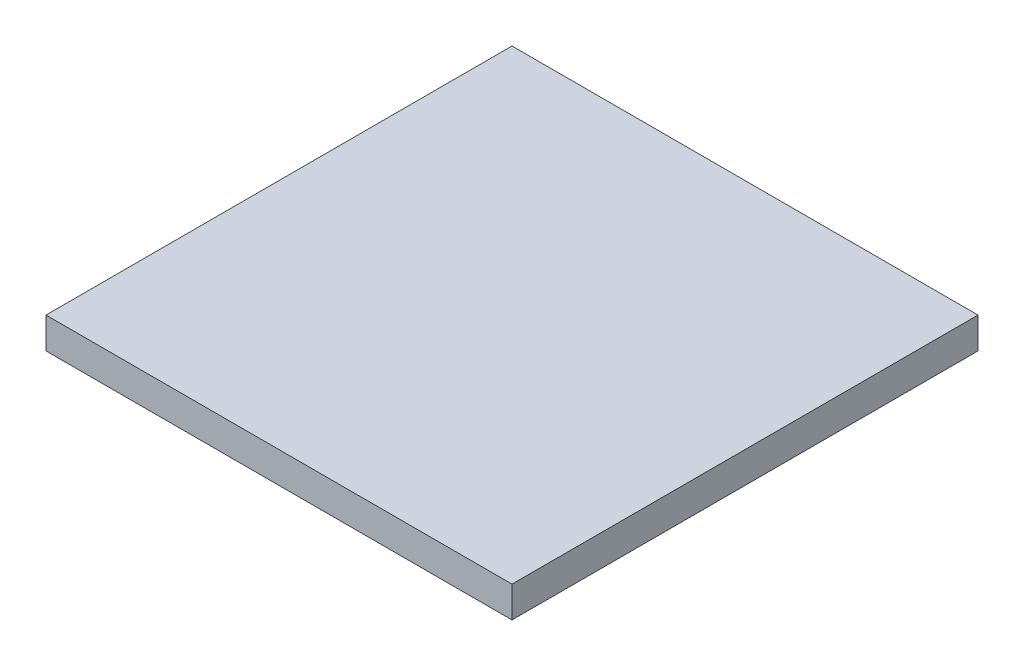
ISO-10303-21;
HEADER;
FILE_DESCRIPTION(('STEP AP214'),'2;1');
FILE_NAME('part.step','',(''),(''),'','','');
FILE_SCHEMA(('AUTOMOTIVE_DESIGN { 1 0 10303 214 1 1 1 1 }'));
ENDSEC;
DATA;
#1=APPLICATION_CONTEXT('core data for automotive mechanical design processes');
#2=APPLICATION_PROTOCOL_DEFINITION('international standard','automotive_design',2000,#1);
#3=PRODUCT_CONTEXT('',#1,'mechanical');
#4=PRODUCT('Part','Part','',(#3));
#5=PRODUCT_RELATED_PRODUCT_CATEGORY('part','',(#4));
#6=PRODUCT_DEFINITION_FORMATION('','',#4);
#7=PRODUCT_DEFINITION_CONTEXT('part definition',#1,'design');
#8=PRODUCT_DEFINITION('design','',#6,#7);
#9=PRODUCT_DEFINITION_SHAPE('','',#8);
#10=(LENGTH_UNIT() NAMED_UNIT(*) SI_UNIT(.MILLI.,.METRE.));
#11=(NAMED_UNIT(*) PLANE_ANGLE_UNIT() SI_UNIT($,.RADIAN.));
#12=(NAMED_UNIT(*) SI_UNIT($,.STERADIAN.) SOLID_ANGLE_UNIT());
#13=UNCERTAINTY_MEASURE_WITH_UNIT(LENGTH_MEASURE(1.E-05),#10,'distance_accuracy_value','');
#14=(GEOMETRIC_REPRESENTATION_CONTEXT(3) GLOBAL_UNCERTAINTY_ASSIGNED_CONTEXT((#13)) GLOBAL_UNIT_ASSIGNED_CONTEXT((#10,
#11,#12)) REPRESENTATION_CONTEXT('',''));
#15=CARTESIAN_POINT('',(0.,0.,0.));
#16=DIRECTION('',(0.,0.,1.));
#17=DIRECTION('',(1.,0.,0.));
#18=AXIS2_PLACEMENT_3D('',#15,#16,#17);
#19=CARTESIAN_POINT('',(0.,4.,0.));
#20=DIRECTION('',(1.,0.,0.));
#21=DIRECTION('',(0.,0.,-1.));
#22=AXIS2_PLACEMENT_3D('',#19,#20,#21);
#23=PLANE('',#22);
#24=DIRECTION('',(0.,0.,1.));
#25=VECTOR('',#24,1.);
#26=CARTESIAN_POINT('',(0.,0.,0.));
#27=LINE('',#26,#25);
#28=CARTESIAN_POINT('',(0.,0.,-60.));
#29=VERTEX_POINT('',#28);
#30=CARTESIAN_POINT('',(0.,0.,0.));
#31=VERTEX_POINT('',#30);
#32=EDGE_CURVE('E94',#29,#31,#27,.T.);
#33=ORIENTED_EDGE('',*,*,#32,.T.);
#34=DIRECTION('',(0.,-1.,0.));
#35=VECTOR('',#34,1.);
#36=CARTESIAN_POINT('',(0.,4.,0.));
#37=LINE('',#36,#35);
#38=CARTESIAN_POINT('',(0.,4.,0.));
#39=VERTEX_POINT('',#38);
#40=EDGE_CURVE('E11',#39,#31,#37,.T.);
#41=ORIENTED_EDGE('',*,*,#40,.F.);
#42=DIRECTION('',(0.,0.,1.));
#43=VECTOR('',#42,1.);
#44=CARTESIAN_POINT('',(0.,4.,0.));
#45=LINE('',#44,#43);
#46=CARTESIAN_POINT('',(0.,4.,-60.));
#47=VERTEX_POINT('',#46);
#48=EDGE_CURVE('E82',#47,#39,#45,.T.);
#49=ORIENTED_EDGE('',*,*,#48,.F.);
#50=DIRECTION('',(0.,-1.,0.));
#51=VECTOR('',#50,1.);
#52=CARTESIAN_POINT('',(0.,4.,-60.));
#53=LINE('',#52,#51);
#54=EDGE_CURVE('E90',#47,#29,#53,.T.);
#55=ORIENTED_EDGE('',*,*,#54,.T.);
#56=EDGE_LOOP('',(#33,#41,#49,#55));
#57=FACE_BOUND('',#56,.T.);
#58=ADVANCED_FACE('F31',(#57),#23,.F.);
#59=CARTESIAN_POINT('',(0.,4.,0.));
#60=DIRECTION('',(0.,0.,-1.));
#61=DIRECTION('',(-1.,0.,0.));
#62=AXIS2_PLACEMENT_3D('',#59,#60,#61);
#63=PLANE('',#62);
#64=DIRECTION('',(1.,0.,0.));
#65=VECTOR('',#64,1.);
#66=CARTESIAN_POINT('',(0.,0.,0.));
#67=LINE('',#66,#65);
#68=CARTESIAN_POINT('',(60.,0.,0.));
#69=VERTEX_POINT('',#68);
#70=EDGE_CURVE('E86',#31,#69,#67,.T.);
#71=ORIENTED_EDGE('',*,*,#70,.T.);
#72=DIRECTION('',(0.,-1.,0.));
#73=VECTOR('',#72,1.);
#74=CARTESIAN_POINT('',(60.,4.,0.));
#75=LINE('',#74,#73);
#76=CARTESIAN_POINT('',(60.,4.,0.));
#77=VERTEX_POINT('',#76);
#78=EDGE_CURVE('E39',#77,#69,#75,.T.);
#79=ORIENTED_EDGE('',*,*,#78,.F.);
#80=DIRECTION('',(1.,0.,0.));
#81=VECTOR('',#80,1.);
#82=CARTESIAN_POINT('',(0.,4.,0.));
#83=LINE('',#82,#81);
#84=EDGE_CURVE('E77',#39,#77,#83,.T.);
#85=ORIENTED_EDGE('',*,*,#84,.F.);
#86=ORIENTED_EDGE('',*,*,#40,.T.);
#87=EDGE_LOOP('',(#71,#79,#85,#86));
#88=FACE_BOUND('',#87,.T.);
#89=ADVANCED_FACE('F85',(#88),#63,.F.);
#90=CARTESIAN_POINT('',(60.,4.,0.));
#91=DIRECTION('',(-1.,0.,0.));
#92=DIRECTION('',(0.,0.,1.));
#93=AXIS2_PLACEMENT_3D('',#90,#91,#92);
#94=PLANE('',#93);
#95=DIRECTION('',(0.,0.,-1.));
#96=VECTOR('',#95,1.);
#97=CARTESIAN_POINT('',(60.,0.,0.));
#98=LINE('',#97,#96);
#99=CARTESIAN_POINT('',(60.,0.,-60.));
#100=VERTEX_POINT('',#99);
#101=EDGE_CURVE('E64',#69,#100,#98,.T.);
#102=ORIENTED_EDGE('',*,*,#101,.T.);
#103=DIRECTION('',(0.,-1.,0.));
#104=VECTOR('',#103,1.);
#105=CARTESIAN_POINT('',(60.,4.,-60.));
#106=LINE('',#105,#104);
#107=CARTESIAN_POINT('',(60.,4.,-60.));
#108=VERTEX_POINT('',#107);
#109=EDGE_CURVE('E87',#108,#100,#106,.T.);
#110=ORIENTED_EDGE('',*,*,#109,.F.);
#111=DIRECTION('',(0.,0.,-1.));
#112=VECTOR('',#111,1.);
#113=CARTESIAN_POINT('',(60.,4.,0.));
#114=LINE('',#113,#112);
#115=EDGE_CURVE('E80',#77,#108,#114,.T.);
#116=ORIENTED_EDGE('',*,*,#115,.F.);
#117=ORIENTED_EDGE('',*,*,#78,.T.);
#118=EDGE_LOOP('',(#102,#110,#116,#117));
#119=FACE_BOUND('',#118,.T.);
#120=ADVANCED_FACE('F88',(#119),#94,.F.);
#121=CARTESIAN_POINT('',(0.,4.,-60.));
#122=DIRECTION('',(0.,0.,1.));
#123=DIRECTION('',(1.,0.,0.));
#124=AXIS2_PLACEMENT_3D('',#121,#122,#123);
#125=PLANE('',#124);
#126=DIRECTION('',(-1.,0.,0.));
#127=VECTOR('',#126,1.);
#128=CARTESIAN_POINT('',(0.,0.,-60.));
#129=LINE('',#128,#127);
#130=EDGE_CURVE('E70',#100,#29,#129,.T.);
#131=ORIENTED_EDGE('',*,*,#130,.T.);
#132=ORIENTED_EDGE('',*,*,#54,.F.);
#133=DIRECTION('',(-1.,0.,0.));
#134=VECTOR('',#133,1.);
#135=CARTESIAN_POINT('',(0.,4.,-60.));
#136=LINE('',#135,#134);
#137=EDGE_CURVE('E47',#108,#47,#136,.T.);
#138=ORIENTED_EDGE('',*,*,#137,.F.);
#139=ORIENTED_EDGE('',*,*,#109,.T.);
#140=EDGE_LOOP('',(#131,#132,#138,#139));
#141=FACE_BOUND('',#140,.T.);
#142=ADVANCED_FACE('F101',(#141),#125,.F.);
#143=CARTESIAN_POINT('',(0.,4.,-60.));
#144=DIRECTION('',(0.,-1.,0.));
#145=DIRECTION('',(0.,0.,-1.));
#146=AXIS2_PLACEMENT_3D('',#143,#144,#145);
#147=PLANE('',#146);
#148=ORIENTED_EDGE('',*,*,#48,.T.);
#149=ORIENTED_EDGE('',*,*,#84,.T.);
#150=ORIENTED_EDGE('',*,*,#115,.T.);
#151=ORIENTED_EDGE('',*,*,#137,.T.);
#152=EDGE_LOOP('',(#148,#149,#150,#151));
#153=FACE_BOUND('',#152,.T.);
#154=ADVANCED_FACE('F78',(#153),#147,.F.);
#155=CARTESIAN_POINT('',(0.,0.,-60.));
#156=DIRECTION('',(0.,-1.,0.));
#157=DIRECTION('',(0.,0.,-1.));
#158=AXIS2_PLACEMENT_3D('',#155,#156,#157);
#159=PLANE('',#158);
#160=ORIENTED_EDGE('',*,*,#32,.F.);
#161=ORIENTED_EDGE('',*,*,#130,.F.);
#162=ORIENTED_EDGE('',*,*,#101,.F.);
#163=ORIENTED_EDGE('',*,*,#70,.F.);
#164=EDGE_LOOP('',(#160,#161,#162,#163));
#165=FACE_BOUND('',#164,.T.);
#166=ADVANCED_FACE('F104',(#165),#159,.T.);
#167=CLOSED_SHELL('',(#58,#89,#120,#142,#154,#166));
#168=MANIFOLD_SOLID_BREP('B2',#167);
#169=ADVANCED_BREP_SHAPE_REPRESENTATION('',(#18,#168),#14);
#170=SHAPE_DEFINITION_REPRESENTATION(#9,#169);
ENDSEC;
END-ISO-10303-21;
